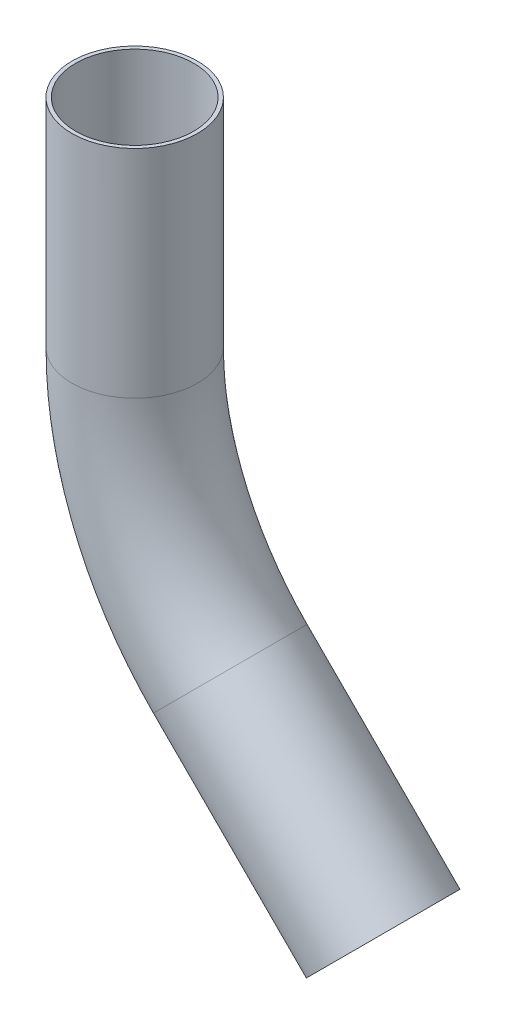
ISO-10303-21;
HEADER;
FILE_DESCRIPTION(('STEP AP214'),'2;1');
FILE_NAME('part.step','',(''),(''),'','','');
FILE_SCHEMA(('AUTOMOTIVE_DESIGN { 1 0 10303 214 1 1 1 1 }'));
ENDSEC;
DATA;
#1=APPLICATION_CONTEXT('core data for automotive mechanical design processes');
#2=APPLICATION_PROTOCOL_DEFINITION('international standard','automotive_design',2000,#1);
#3=PRODUCT_CONTEXT('',#1,'mechanical');
#4=PRODUCT('Part','Part','',(#3));
#5=PRODUCT_RELATED_PRODUCT_CATEGORY('part','',(#4));
#6=PRODUCT_DEFINITION_FORMATION('','',#4);
#7=PRODUCT_DEFINITION_CONTEXT('part definition',#1,'design');
#8=PRODUCT_DEFINITION('design','',#6,#7);
#9=PRODUCT_DEFINITION_SHAPE('','',#8);
#10=(LENGTH_UNIT() NAMED_UNIT(*) SI_UNIT(.MILLI.,.METRE.));
#11=(NAMED_UNIT(*) PLANE_ANGLE_UNIT() SI_UNIT($,.RADIAN.));
#12=(NAMED_UNIT(*) SI_UNIT($,.STERADIAN.) SOLID_ANGLE_UNIT());
#13=UNCERTAINTY_MEASURE_WITH_UNIT(LENGTH_MEASURE(1.E-05),#10,'distance_accuracy_value','');
#14=(GEOMETRIC_REPRESENTATION_CONTEXT(3) GLOBAL_UNCERTAINTY_ASSIGNED_CONTEXT((#13)) GLOBAL_UNIT_ASSIGNED_CONTEXT((#10,
#11,#12)) REPRESENTATION_CONTEXT('',''));
#15=CARTESIAN_POINT('',(0.,0.,0.));
#16=DIRECTION('',(0.,0.,1.));
#17=DIRECTION('',(1.,0.,0.));
#18=AXIS2_PLACEMENT_3D('',#15,#16,#17);
#19=CARTESIAN_POINT('',(38.0761184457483,-178.076118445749,0.));
#20=DIRECTION('',(0.707106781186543,-0.707106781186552,0.));
#21=DIRECTION('',(0.707106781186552,0.707106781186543,0.));
#22=AXIS2_PLACEMENT_3D('',#19,#20,#21);
#23=CYLINDRICAL_SURFACE('',#22,25.);
#24=CARTESIAN_POINT('',(38.0761184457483,-178.076118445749,0.));
#25=DIRECTION('',(-0.707106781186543,0.707106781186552,0.));
#26=DIRECTION('',(0.,0.,1.));
#27=AXIS2_PLACEMENT_3D('',#24,#25,#26);
#28=CIRCLE('',#27,25.);
#29=CARTESIAN_POINT('',(20.3984489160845,-195.753787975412,0.));
#30=VERTEX_POINT('',#29);
#31=EDGE_CURVE('E50',#30,#30,#28,.T.);
#32=ORIENTED_EDGE('',*,*,#31,.F.);
#33=EDGE_LOOP('',(#32));
#34=FACE_BOUND('',#33,.T.);
#35=CARTESIAN_POINT('',(98.9949493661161,-238.994949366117,0.));
#36=DIRECTION('',(-0.707106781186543,0.707106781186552,0.));
#37=DIRECTION('',(0.,0.,1.));
#38=AXIS2_PLACEMENT_3D('',#35,#36,#37);
#39=CIRCLE('',#38,25.);
#40=CARTESIAN_POINT('',(98.9949493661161,-238.994949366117,25.));
#41=VERTEX_POINT('',#40);
#42=EDGE_CURVE('E13',#41,#41,#39,.T.);
#43=ORIENTED_EDGE('',*,*,#42,.T.);
#44=EDGE_LOOP('',(#43));
#45=FACE_BOUND('',#44,.T.);
#46=ADVANCED_FACE('F44',(#34,#45),#23,.T.);
#47=CARTESIAN_POINT('',(130.,-86.152236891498,0.));
#48=DIRECTION('',(0.,0.,1.));
#49=DIRECTION('',(1.,0.,0.));
#50=AXIS2_PLACEMENT_3D('',#47,#48,#49);
#51=TOROIDAL_SURFACE('',#50,130.,25.);
#52=CARTESIAN_POINT('',(0.,-86.1522368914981,0.));
#53=DIRECTION('',(0.,1.,0.));
#54=DIRECTION('',(0.,0.,1.));
#55=AXIS2_PLACEMENT_3D('',#52,#53,#54);
#56=CIRCLE('',#55,25.);
#57=CARTESIAN_POINT('',(-25.,-86.1522368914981,0.));
#58=VERTEX_POINT('',#57);
#59=EDGE_CURVE('E54',#58,#58,#56,.T.);
#60=CARTESIAN_POINT('',(130.,-86.152236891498,0.));
#61=DIRECTION('',(0.,0.,1.));
#62=DIRECTION('',(1.,0.,0.));
#63=AXIS2_PLACEMENT_3D('',#60,#61,#62);
#64=CIRCLE('',#63,155.);
#65=EDGE_CURVE('',#58,#30,#64,.T.);
#66=ORIENTED_EDGE('',*,*,#59,.F.);
#67=ORIENTED_EDGE('',*,*,#31,.T.);
#68=ORIENTED_EDGE('',*,*,#65,.T.);
#69=ORIENTED_EDGE('',*,*,#65,.F.);
#70=EDGE_LOOP('',(#66,#68,#67,#69));
#71=FACE_BOUND('',#70,.T.);
#72=ADVANCED_FACE('F93',(#71),#51,.T.);
#73=CARTESIAN_POINT('',(0.,-86.1522368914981,0.));
#74=DIRECTION('',(0.,1.,0.));
#75=DIRECTION('',(0.,0.,1.));
#76=AXIS2_PLACEMENT_3D('',#73,#74,#75);
#77=CYLINDRICAL_SURFACE('',#76,25.);
#78=ORIENTED_EDGE('',*,*,#59,.T.);
#79=EDGE_LOOP('',(#78));
#80=FACE_BOUND('',#79,.T.);
#81=CARTESIAN_POINT('',(0.,0.,0.));
#82=DIRECTION('',(0.,1.,0.));
#83=DIRECTION('',(0.,0.,1.));
#84=AXIS2_PLACEMENT_3D('',#81,#82,#83);
#85=CIRCLE('',#84,25.);
#86=CARTESIAN_POINT('',(0.,0.,25.));
#87=VERTEX_POINT('',#86);
#88=EDGE_CURVE('E58',#87,#87,#85,.T.);
#89=ORIENTED_EDGE('',*,*,#88,.F.);
#90=EDGE_LOOP('',(#89));
#91=FACE_BOUND('',#90,.T.);
#92=ADVANCED_FACE('F98',(#80,#91),#77,.T.);
#93=CARTESIAN_POINT('',(98.9949493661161,-238.994949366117,0.));
#94=DIRECTION('',(-0.707106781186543,0.707106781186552,0.));
#95=DIRECTION('',(0.,0.,1.));
#96=AXIS2_PLACEMENT_3D('',#93,#94,#95);
#97=PLANE('',#96);
#98=CARTESIAN_POINT('',(98.9949493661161,-238.994949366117,0.));
#99=DIRECTION('',(-0.707106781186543,0.707106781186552,0.));
#100=DIRECTION('',(-0.707106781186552,-0.707106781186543,0.));
#101=AXIS2_PLACEMENT_3D('',#98,#99,#100);
#102=CIRCLE('',#101,23.5);
#103=CARTESIAN_POINT('',(82.3779400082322,-255.611958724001,0.));
#104=VERTEX_POINT('',#103);
#105=EDGE_CURVE('E63',#104,#104,#102,.T.);
#106=ORIENTED_EDGE('',*,*,#105,.T.);
#107=EDGE_LOOP('',(#106));
#108=FACE_BOUND('',#107,.T.);
#109=ORIENTED_EDGE('',*,*,#42,.F.);
#110=EDGE_LOOP('',(#109));
#111=FACE_BOUND('',#110,.T.);
#112=ADVANCED_FACE('F103',(#108,#111),#97,.F.);
#113=CARTESIAN_POINT('',(0.,0.,0.));
#114=DIRECTION('',(0.,1.,0.));
#115=DIRECTION('',(0.,0.,1.));
#116=AXIS2_PLACEMENT_3D('',#113,#114,#115);
#117=PLANE('',#116);
#118=CARTESIAN_POINT('',(0.,0.,0.));
#119=DIRECTION('',(0.,1.,0.));
#120=DIRECTION('',(0.,0.,1.));
#121=AXIS2_PLACEMENT_3D('',#118,#119,#120);
#122=CIRCLE('',#121,23.5);
#123=CARTESIAN_POINT('',(0.,0.,23.5));
#124=VERTEX_POINT('',#123);
#125=EDGE_CURVE('E64',#124,#124,#122,.T.);
#126=ORIENTED_EDGE('',*,*,#125,.F.);
#127=EDGE_LOOP('',(#126));
#128=FACE_BOUND('',#127,.T.);
#129=ORIENTED_EDGE('',*,*,#88,.T.);
#130=EDGE_LOOP('',(#129));
#131=FACE_BOUND('',#130,.T.);
#132=ADVANCED_FACE('F90',(#128,#131),#117,.T.);
#133=CARTESIAN_POINT('',(38.0761184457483,-178.076118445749,0.));
#134=DIRECTION('',(0.707106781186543,-0.707106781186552,0.));
#135=DIRECTION('',(0.707106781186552,0.707106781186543,0.));
#136=AXIS2_PLACEMENT_3D('',#133,#134,#135);
#137=CYLINDRICAL_SURFACE('',#136,23.5);
#138=CARTESIAN_POINT('',(38.0761184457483,-178.076118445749,0.));
#139=DIRECTION('',(-0.707106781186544,0.707106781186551,0.));
#140=DIRECTION('',(-0.707106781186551,-0.707106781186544,0.));
#141=AXIS2_PLACEMENT_3D('',#138,#139,#140);
#142=CIRCLE('',#141,23.5);
#143=CARTESIAN_POINT('',(21.4591090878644,-194.693127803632,0.));
#144=VERTEX_POINT('',#143);
#145=EDGE_CURVE('E70',#144,#144,#142,.T.);
#146=ORIENTED_EDGE('',*,*,#145,.T.);
#147=EDGE_LOOP('',(#146));
#148=FACE_BOUND('',#147,.T.);
#149=ORIENTED_EDGE('',*,*,#105,.F.);
#150=EDGE_LOOP('',(#149));
#151=FACE_BOUND('',#150,.T.);
#152=ADVANCED_FACE('F76',(#148,#151),#137,.F.);
#153=CARTESIAN_POINT('',(130.,-86.152236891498,0.));
#154=DIRECTION('',(0.,0.,1.));
#155=DIRECTION('',(1.,0.,0.));
#156=AXIS2_PLACEMENT_3D('',#153,#154,#155);
#157=TOROIDAL_SURFACE('',#156,130.,23.5);
#158=CARTESIAN_POINT('',(0.,-86.1522368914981,0.));
#159=DIRECTION('',(0.,1.,0.));
#160=DIRECTION('',(0.,0.,1.));
#161=AXIS2_PLACEMENT_3D('',#158,#159,#160);
#162=CIRCLE('',#161,23.5);
#163=CARTESIAN_POINT('',(-23.5,-86.1522368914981,0.));
#164=VERTEX_POINT('',#163);
#165=EDGE_CURVE('E67',#164,#164,#162,.T.);
#166=CARTESIAN_POINT('',(130.,-86.152236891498,0.));
#167=DIRECTION('',(0.,0.,1.));
#168=DIRECTION('',(1.,0.,0.));
#169=AXIS2_PLACEMENT_3D('',#166,#167,#168);
#170=CIRCLE('',#169,153.5);
#171=EDGE_CURVE('',#164,#144,#170,.T.);
#172=ORIENTED_EDGE('',*,*,#165,.T.);
#173=ORIENTED_EDGE('',*,*,#145,.F.);
#174=ORIENTED_EDGE('',*,*,#171,.T.);
#175=ORIENTED_EDGE('',*,*,#171,.F.);
#176=EDGE_LOOP('',(#172,#174,#173,#175));
#177=FACE_BOUND('',#176,.T.);
#178=ADVANCED_FACE('F79',(#177),#157,.F.);
#179=CARTESIAN_POINT('',(0.,-86.1522368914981,0.));
#180=DIRECTION('',(0.,1.,0.));
#181=DIRECTION('',(0.,0.,1.));
#182=AXIS2_PLACEMENT_3D('',#179,#180,#181);
#183=CYLINDRICAL_SURFACE('',#182,23.5);
#184=ORIENTED_EDGE('',*,*,#165,.F.);
#185=EDGE_LOOP('',(#184));
#186=FACE_BOUND('',#185,.T.);
#187=ORIENTED_EDGE('',*,*,#125,.T.);
#188=EDGE_LOOP('',(#187));
#189=FACE_BOUND('',#188,.T.);
#190=ADVANCED_FACE('F81',(#186,#189),#183,.F.);
#191=CLOSED_SHELL('',(#46,#72,#92,#112,#132,#152,#178,#190));
#192=MANIFOLD_SOLID_BREP('B2',#191);
#193=ADVANCED_BREP_SHAPE_REPRESENTATION('',(#18,#192),#14);
#194=SHAPE_DEFINITION_REPRESENTATION(#9,#193);
ENDSEC;
END-ISO-10303-21;
